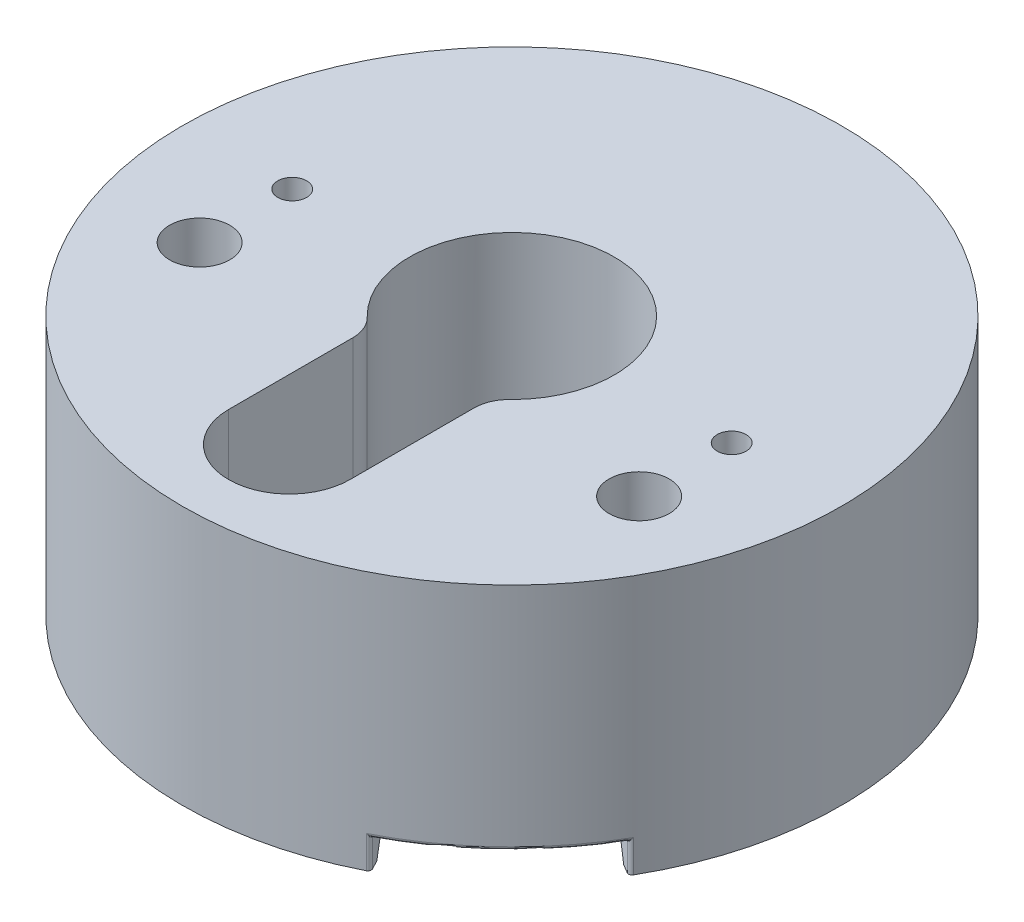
ISO-10303-21;
HEADER;
FILE_DESCRIPTION(('STEP AP214'),'2;1');
FILE_NAME('part.step','',(''),(''),'','','');
FILE_SCHEMA(('AUTOMOTIVE_DESIGN { 1 0 10303 214 1 1 1 1 }'));
ENDSEC;
DATA;
#1=APPLICATION_CONTEXT('core data for automotive mechanical design processes');
#2=APPLICATION_PROTOCOL_DEFINITION('international standard','automotive_design',2000,#1);
#3=PRODUCT_CONTEXT('',#1,'mechanical');
#4=PRODUCT('Part','Part','',(#3));
#5=PRODUCT_RELATED_PRODUCT_CATEGORY('part','',(#4));
#6=PRODUCT_DEFINITION_FORMATION('','',#4);
#7=PRODUCT_DEFINITION_CONTEXT('part definition',#1,'design');
#8=PRODUCT_DEFINITION('design','',#6,#7);
#9=PRODUCT_DEFINITION_SHAPE('','',#8);
#10=(LENGTH_UNIT() NAMED_UNIT(*) SI_UNIT(.MILLI.,.METRE.));
#11=(NAMED_UNIT(*) PLANE_ANGLE_UNIT() SI_UNIT($,.RADIAN.));
#12=(NAMED_UNIT(*) SI_UNIT($,.STERADIAN.) SOLID_ANGLE_UNIT());
#13=UNCERTAINTY_MEASURE_WITH_UNIT(LENGTH_MEASURE(1.E-05),#10,'distance_accuracy_value','');
#14=(GEOMETRIC_REPRESENTATION_CONTEXT(3) GLOBAL_UNCERTAINTY_ASSIGNED_CONTEXT((#13)) GLOBAL_UNIT_ASSIGNED_CONTEXT((#10,
#11,#12)) REPRESENTATION_CONTEXT('',''));
#15=CARTESIAN_POINT('',(0.,0.,0.));
#16=DIRECTION('',(0.,0.,1.));
#17=DIRECTION('',(1.,0.,0.));
#18=AXIS2_PLACEMENT_3D('',#15,#16,#17);
#19=CARTESIAN_POINT('',(0.,22.4,0.));
#20=DIRECTION('',(0.,-1.,0.));
#21=DIRECTION('',(0.,0.,-1.));
#22=AXIS2_PLACEMENT_3D('',#19,#20,#21);
#23=CYLINDRICAL_SURFACE('',#22,28.5);
#24=CARTESIAN_POINT('',(0.,0.,0.));
#25=DIRECTION('',(0.,1.,0.));
#26=DIRECTION('',(0.,0.,1.));
#27=AXIS2_PLACEMENT_3D('',#24,#25,#26);
#28=CIRCLE('',#27,28.5);
#29=CARTESIAN_POINT('',(24.7060394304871,0.,14.2078012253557));
#30=VERTEX_POINT('',#29);
#31=CARTESIAN_POINT('',(12.8457736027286,0.,25.4408352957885));
#32=VERTEX_POINT('',#31);
#33=EDGE_CURVE('E194',#30,#32,#28,.T.);
#34=ORIENTED_EDGE('',*,*,#33,.T.);
#35=DIRECTION('',(0.,-1.,0.));
#36=VECTOR('',#35,1.);
#37=CARTESIAN_POINT('',(12.8457736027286,22.4,25.4408352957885));
#38=LINE('',#37,#36);
#39=CARTESIAN_POINT('',(12.8457736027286,2.8,25.4408352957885));
#40=VERTEX_POINT('',#39);
#41=EDGE_CURVE('E275',#32,#40,#38,.F.);
#42=ORIENTED_EDGE('',*,*,#41,.T.);
#43=CARTESIAN_POINT('',(0.,2.8,0.));
#44=DIRECTION('',(0.,-1.,0.));
#45=DIRECTION('',(0.,0.,-1.));
#46=AXIS2_PLACEMENT_3D('',#43,#44,#45);
#47=CIRCLE('',#46,28.5);
#48=CARTESIAN_POINT('',(24.7060394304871,2.8,14.2078012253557));
#49=VERTEX_POINT('',#48);
#50=EDGE_CURVE('E269',#40,#49,#47,.F.);
#51=ORIENTED_EDGE('',*,*,#50,.T.);
#52=DIRECTION('',(0.,-1.,0.));
#53=VECTOR('',#52,1.);
#54=CARTESIAN_POINT('',(24.7060394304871,22.4,14.2078012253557));
#55=LINE('',#54,#53);
#56=EDGE_CURVE('E272',#49,#30,#55,.T.);
#57=ORIENTED_EDGE('',*,*,#56,.T.);
#58=EDGE_LOOP('',(#34,#42,#51,#57));
#59=FACE_BOUND('',#58,.T.);
#60=CARTESIAN_POINT('',(0.,22.4,0.));
#61=DIRECTION('',(0.,1.,0.));
#62=DIRECTION('',(0.,0.,1.));
#63=AXIS2_PLACEMENT_3D('',#60,#61,#62);
#64=CIRCLE('',#63,28.5);
#65=CARTESIAN_POINT('',(0.,22.4,28.5));
#66=VERTEX_POINT('',#65);
#67=EDGE_CURVE('E202',#66,#66,#64,.T.);
#68=ORIENTED_EDGE('',*,*,#67,.F.);
#69=EDGE_LOOP('',(#68));
#70=FACE_BOUND('',#69,.T.);
#71=ADVANCED_FACE('F48',(#59,#70),#23,.T.);
#72=CARTESIAN_POINT('',(0.,0.,0.));
#73=DIRECTION('',(0.,1.,0.));
#74=DIRECTION('',(0.,0.,1.));
#75=AXIS2_PLACEMENT_3D('',#72,#73,#74);
#76=PLANE('',#75);
#77=DIRECTION('',(0.460199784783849,0.,0.887815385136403));
#78=VECTOR('',#77,1.);
#79=CARTESIAN_POINT('',(13.1156938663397,0.,25.3027384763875));
#80=LINE('',#79,#78);
#81=CARTESIAN_POINT('',(12.5749591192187,0.,24.2595553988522));
#82=VERTEX_POINT('',#81);
#83=CARTESIAN_POINT('',(12.9768995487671,0.,25.0349770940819));
#84=VERTEX_POINT('',#83);
#85=EDGE_CURVE('E183',#82,#84,#80,.T.);
#86=ORIENTED_EDGE('',*,*,#85,.T.);
#87=CARTESIAN_POINT('',(12.7105549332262,0.,25.1730370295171));
#88=DIRECTION('',(0.,1.,0.));
#89=DIRECTION('',(0.,0.,1.));
#90=AXIS2_PLACEMENT_3D('',#87,#88,#89);
#91=CIRCLE('',#90,0.3);
#92=EDGE_CURVE('E284',#84,#32,#91,.F.);
#93=ORIENTED_EDGE('',*,*,#92,.T.);
#94=ORIENTED_EDGE('',*,*,#33,.F.);
#95=CARTESIAN_POINT('',(24.4459758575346,0.,14.0582454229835));
#96=DIRECTION('',(0.,1.,0.));
#97=DIRECTION('',(0.,0.,1.));
#98=AXIS2_PLACEMENT_3D('',#95,#96,#97);
#99=CIRCLE('',#98,0.3);
#100=CARTESIAN_POINT('',(24.293661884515,0.,14.3167032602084));
#101=VERTEX_POINT('',#100);
#102=EDGE_CURVE('E181',#30,#101,#99,.F.);
#103=ORIENTED_EDGE('',*,*,#102,.T.);
#104=DIRECTION('',(-0.861526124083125,0.,-0.507713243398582));
#105=VECTOR('',#104,1.);
#106=CARTESIAN_POINT('',(22.4437776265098,0.,13.2265323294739));
#107=LINE('',#106,#105);
#108=CARTESIAN_POINT('',(23.5412013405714,0.,13.8732643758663));
#109=VERTEX_POINT('',#108);
#110=EDGE_CURVE('E167',#101,#109,#107,.T.);
#111=ORIENTED_EDGE('',*,*,#110,.T.);
#112=CARTESIAN_POINT('',(0.,0.,0.));
#113=DIRECTION('',(0.,-1.,0.));
#114=DIRECTION('',(0.,0.,-1.));
#115=AXIS2_PLACEMENT_3D('',#112,#113,#114);
#116=CIRCLE('',#115,27.325);
#117=EDGE_CURVE('E178',#82,#109,#116,.T.);
#118=ORIENTED_EDGE('',*,*,#117,.F.);
#119=EDGE_LOOP('',(#86,#93,#94,#103,#111,#118));
#120=FACE_BOUND('',#119,.T.);
#121=ADVANCED_FACE('F177',(#120),#76,.F.);
#122=CARTESIAN_POINT('',(0.,0.,0.));
#123=DIRECTION('',(0.,-1.,0.));
#124=DIRECTION('',(0.,0.,-1.));
#125=AXIS2_PLACEMENT_3D('',#122,#123,#124);
#126=CONICAL_SURFACE('',#125,27.325,0.47123889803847);
#127=DIRECTION('',(0.208926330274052,-0.891006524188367,0.403059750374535));
#128=VECTOR('',#127,1.);
#129=CARTESIAN_POINT('',(0.,53.6283320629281,0.));
#130=LINE('',#129,#128);
#131=CARTESIAN_POINT('',(12.0121987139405,2.40000000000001,23.1738805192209));
#132=VERTEX_POINT('',#131);
#133=EDGE_CURVE('E172',#82,#132,#130,.F.);
#134=ORIENTED_EDGE('',*,*,#133,.F.);
#135=ORIENTED_EDGE('',*,*,#117,.T.);
#136=DIRECTION('',(-0.391124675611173,0.891006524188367,-0.230496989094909));
#137=VECTOR('',#136,1.);
#138=CARTESIAN_POINT('',(0.,53.6283320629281,0.));
#139=LINE('',#138,#137);
#140=CARTESIAN_POINT('',(22.4876745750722,2.40000000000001,13.2524016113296));
#141=VERTEX_POINT('',#140);
#142=EDGE_CURVE('E164',#141,#109,#139,.F.);
#143=ORIENTED_EDGE('',*,*,#142,.F.);
#144=CARTESIAN_POINT('',(22.4876745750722,2.4,13.2524016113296));
#145=CARTESIAN_POINT('',(22.4849688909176,2.40616565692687,13.2508049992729));
#146=CARTESIAN_POINT('',(22.4819705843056,2.41233441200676,13.2497021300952));
#147=CARTESIAN_POINT('',(22.475460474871,2.42452213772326,13.2485175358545));
#148=CARTESIAN_POINT('',(22.471947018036,2.43054054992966,13.248439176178));
#149=CARTESIAN_POINT('',(22.4644907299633,2.44223895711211,13.2493490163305));
#150=CARTESIAN_POINT('',(22.4605471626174,2.44791834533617,13.250339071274));
#151=CARTESIAN_POINT('',(22.4523437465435,2.45872170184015,13.2534094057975));
#152=CARTESIAN_POINT('',(22.4480843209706,2.46384639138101,13.2554882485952));
#153=CARTESIAN_POINT('',(22.4396644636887,2.47301513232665,13.2605564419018));
#154=CARTESIAN_POINT('',(22.4355160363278,2.47710816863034,13.2634766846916));
#155=CARTESIAN_POINT('',(22.4271889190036,2.48443503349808,13.2702225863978));
#156=CARTESIAN_POINT('',(22.4230102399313,2.48766915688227,13.2740479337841));
#157=CARTESIAN_POINT('',(22.4152608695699,2.49278378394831,13.2820180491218));
#158=CARTESIAN_POINT('',(22.4116752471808,2.49477670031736,13.2860764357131));
#159=CARTESIAN_POINT('',(22.4047438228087,2.49783714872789,13.2947062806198));
#160=CARTESIAN_POINT('',(22.4013974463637,2.49890697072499,13.2992764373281));
#161=CARTESIAN_POINT('',(22.3973035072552,2.49965761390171,13.3054199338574));
#162=CARTESIAN_POINT('',(22.3963859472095,2.49978601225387,13.3068362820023));
#163=CARTESIAN_POINT('',(22.3945865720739,2.49995707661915,13.3096936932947));
#164=CARTESIAN_POINT('',(22.3937047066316,2.49999986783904,13.3111347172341));
#165=CARTESIAN_POINT('',(22.3928409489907,2.5,13.3125874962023));
#166=B_SPLINE_CURVE_WITH_KNOTS('',3,(#144,#145,#146,#147,#148,#149,#150,#151,#152,#153,#154,
#155,#156,#157,#158,#159,#160,#161,#162,#163,#164,#165),.UNSPECIFIED.,.F.,.F.,(4,2,2,2,2,2,2,2,
2,2,4),(0.,0.0207420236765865,0.0415521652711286,0.0623984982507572,0.083217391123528,
0.10266296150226,0.122101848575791,0.139320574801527,0.156496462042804,0.161571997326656,
0.166640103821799),.UNSPECIFIED.);
#167=CARTESIAN_POINT('',(22.3928409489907,2.5,13.3125874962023));
#168=VERTEX_POINT('',#167);
#169=EDGE_CURVE('E11',#141,#168,#166,.T.);
#170=ORIENTED_EDGE('',*,*,#169,.T.);
#171=CARTESIAN_POINT('',(0.,2.5,0.));
#172=DIRECTION('',(0.,-1.,0.));
#173=DIRECTION('',(0.,0.,-1.));
#174=AXIS2_PLACEMENT_3D('',#171,#172,#173);
#175=CIRCLE('',#174,26.0511863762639);
#176=CARTESIAN_POINT('',(12.0774435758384,2.5,23.0824536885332));
#177=VERTEX_POINT('',#176);
#178=EDGE_CURVE('E187',#177,#168,#175,.T.);
#179=ORIENTED_EDGE('',*,*,#178,.F.);
#180=CARTESIAN_POINT('',(12.0774435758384,2.5,23.0824536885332));
#181=CARTESIAN_POINT('',(12.0728352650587,2.50000635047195,23.0848613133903));
#182=CARTESIAN_POINT('',(12.0683293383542,2.49959496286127,23.0874537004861));
#183=CARTESIAN_POINT('',(12.0596550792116,2.49798835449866,23.0929093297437));
#184=CARTESIAN_POINT('',(12.0554855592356,2.49679603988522,23.0957715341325));
#185=CARTESIAN_POINT('',(12.047583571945,2.4936795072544,23.1016854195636));
#186=CARTESIAN_POINT('',(12.043850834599,2.49175574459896,23.1047369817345));
#187=CARTESIAN_POINT('',(12.0368979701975,2.48725714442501,23.1109444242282));
#188=CARTESIAN_POINT('',(12.0336781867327,2.48468187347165,23.1141003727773));
#189=CARTESIAN_POINT('',(12.0276799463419,2.47884863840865,23.1205725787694));
#190=CARTESIAN_POINT('',(12.0249268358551,2.47556581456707,23.1238898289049));
#191=CARTESIAN_POINT('',(12.0200739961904,2.46850214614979,23.1304689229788));
#192=CARTESIAN_POINT('',(12.0179744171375,2.46472118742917,23.1337307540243));
#193=CARTESIAN_POINT('',(12.0142601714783,2.45635808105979,23.1404613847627));
#194=CARTESIAN_POINT('',(12.0127173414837,2.45173353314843,23.1439170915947));
#195=CARTESIAN_POINT('',(12.0104393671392,2.44213626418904,23.1506084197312));
#196=CARTESIAN_POINT('',(12.0097049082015,2.43716325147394,23.1538438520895));
#197=CARTESIAN_POINT('',(12.0090247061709,2.42688175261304,23.1600978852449));
#198=CARTESIAN_POINT('',(12.0090965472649,2.42156831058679,23.1631102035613));
#199=CARTESIAN_POINT('',(12.0100486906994,2.41083583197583,23.1687761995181));
#200=CARTESIAN_POINT('',(12.0109275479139,2.40541700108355,23.171430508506));
#201=CARTESIAN_POINT('',(12.0121987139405,2.4,23.1738805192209));
#202=B_SPLINE_CURVE_WITH_KNOTS('',3,(#180,#181,#182,#183,#184,#185,#186,#187,#188,#189,#190,
#191,#192,#193,#194,#195,#196,#197,#198,#199,#200,#201),.UNSPECIFIED.,.F.,.F.,(4,2,2,2,2,2,2,2,
2,2,4),(0.,0.0155697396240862,0.0310818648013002,0.0465843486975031,0.0620971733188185,
0.0782860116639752,0.0944785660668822,0.112332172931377,0.130200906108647,0.148460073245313,
0.166686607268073),.UNSPECIFIED.);
#203=EDGE_CURVE('E59',#177,#132,#202,.T.);
#204=ORIENTED_EDGE('',*,*,#203,.T.);
#205=EDGE_LOOP('',(#134,#135,#143,#170,#179,#204));
#206=FACE_BOUND('',#205,.T.);
#207=ADVANCED_FACE('F185',(#206),#126,.F.);
#208=CARTESIAN_POINT('',(0.,22.4,0.));
#209=DIRECTION('',(0.,1.,0.));
#210=DIRECTION('',(0.,0.,1.));
#211=AXIS2_PLACEMENT_3D('',#208,#209,#210);
#212=PLANE('',#211);
#213=CARTESIAN_POINT('',(19.,22.4,8.));
#214=DIRECTION('',(0.,1.,0.));
#215=DIRECTION('',(0.,0.,1.));
#216=AXIS2_PLACEMENT_3D('',#213,#214,#215);
#217=CIRCLE('',#216,2.6);
#218=CARTESIAN_POINT('',(19.,22.4,10.6));
#219=VERTEX_POINT('',#218);
#220=EDGE_CURVE('E431',#219,#219,#217,.T.);
#221=ORIENTED_EDGE('',*,*,#220,.F.);
#222=EDGE_LOOP('',(#221));
#223=FACE_BOUND('',#222,.T.);
#224=CARTESIAN_POINT('',(-19.,22.4,7.99999999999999));
#225=DIRECTION('',(0.,1.,0.));
#226=DIRECTION('',(0.,0.,1.));
#227=AXIS2_PLACEMENT_3D('',#224,#225,#226);
#228=CIRCLE('',#227,2.6);
#229=CARTESIAN_POINT('',(-19.,22.4,10.6));
#230=VERTEX_POINT('',#229);
#231=EDGE_CURVE('E449',#230,#230,#228,.T.);
#232=ORIENTED_EDGE('',*,*,#231,.F.);
#233=EDGE_LOOP('',(#232));
#234=FACE_BOUND('',#233,.T.);
#235=DIRECTION('',(0.,0.,1.));
#236=VECTOR('',#235,1.);
#237=CARTESIAN_POINT('',(-5.25,22.4,7.12460525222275));
#238=LINE('',#237,#236);
#239=CARTESIAN_POINT('',(-5.25,22.4,8.50646812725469));
#240=VERTEX_POINT('',#239);
#241=CARTESIAN_POINT('',(-5.25,22.4,19.25));
#242=VERTEX_POINT('',#241);
#243=EDGE_CURVE('E472',#240,#242,#238,.T.);
#244=ORIENTED_EDGE('',*,*,#243,.F.);
#245=CARTESIAN_POINT('',(-8.25,22.4,8.50646812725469));
#246=DIRECTION('',(0.,1.,0.));
#247=DIRECTION('',(0.,0.,1.));
#248=AXIS2_PLACEMENT_3D('',#245,#246,#247);
#249=CIRCLE('',#248,3.);
#250=CARTESIAN_POINT('',(-6.16139240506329,22.4,6.35293189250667));
#251=VERTEX_POINT('',#250);
#252=EDGE_CURVE('E216',#240,#251,#249,.T.);
#253=ORIENTED_EDGE('',*,*,#252,.T.);
#254=CARTESIAN_POINT('',(0.,22.4,0.));
#255=DIRECTION('',(0.,1.,0.));
#256=DIRECTION('',(0.,0.,1.));
#257=AXIS2_PLACEMENT_3D('',#254,#255,#256);
#258=CIRCLE('',#257,8.85);
#259=CARTESIAN_POINT('',(6.16139240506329,22.4,6.35293189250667));
#260=VERTEX_POINT('',#259);
#261=EDGE_CURVE('E456',#260,#251,#258,.T.);
#262=ORIENTED_EDGE('',*,*,#261,.F.);
#263=CARTESIAN_POINT('',(8.25,22.4,8.50646812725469));
#264=DIRECTION('',(0.,1.,0.));
#265=DIRECTION('',(0.,0.,1.));
#266=AXIS2_PLACEMENT_3D('',#263,#264,#265);
#267=CIRCLE('',#266,3.);
#268=CARTESIAN_POINT('',(5.25,22.4,8.50646812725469));
#269=VERTEX_POINT('',#268);
#270=EDGE_CURVE('E213',#260,#269,#267,.T.);
#271=ORIENTED_EDGE('',*,*,#270,.T.);
#272=DIRECTION('',(0.,0.,-1.));
#273=VECTOR('',#272,1.);
#274=CARTESIAN_POINT('',(5.25,22.4,7.12460525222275));
#275=LINE('',#274,#273);
#276=CARTESIAN_POINT('',(5.25,22.4,19.25));
#277=VERTEX_POINT('',#276);
#278=EDGE_CURVE('E461',#277,#269,#275,.T.);
#279=ORIENTED_EDGE('',*,*,#278,.F.);
#280=CARTESIAN_POINT('',(0.,22.4,19.25));
#281=DIRECTION('',(0.,1.,0.));
#282=DIRECTION('',(0.,0.,1.));
#283=AXIS2_PLACEMENT_3D('',#280,#281,#282);
#284=CIRCLE('',#283,5.25);
#285=EDGE_CURVE('E475',#242,#277,#284,.T.);
#286=ORIENTED_EDGE('',*,*,#285,.F.);
#287=EDGE_LOOP('',(#244,#253,#262,#271,#279,#286));
#288=FACE_BOUND('',#287,.T.);
#289=CARTESIAN_POINT('',(19.,22.4,0.));
#290=DIRECTION('',(0.,-1.,0.));
#291=DIRECTION('',(0.,0.,-1.));
#292=AXIS2_PLACEMENT_3D('',#289,#290,#291);
#293=CIRCLE('',#292,1.24999999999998);
#294=CARTESIAN_POINT('',(19.,22.4,-1.24999999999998));
#295=VERTEX_POINT('',#294);
#296=EDGE_CURVE('E496',#295,#295,#293,.T.);
#297=ORIENTED_EDGE('',*,*,#296,.T.);
#298=EDGE_LOOP('',(#297));
#299=FACE_BOUND('',#298,.T.);
#300=CARTESIAN_POINT('',(-19.,22.4,0.));
#301=DIRECTION('',(0.,-1.,0.));
#302=DIRECTION('',(0.,0.,-1.));
#303=AXIS2_PLACEMENT_3D('',#300,#301,#302);
#304=CIRCLE('',#303,1.24999999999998);
#305=CARTESIAN_POINT('',(-19.,22.4,-1.24999999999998));
#306=VERTEX_POINT('',#305);
#307=EDGE_CURVE('E188',#306,#306,#304,.T.);
#308=ORIENTED_EDGE('',*,*,#307,.T.);
#309=EDGE_LOOP('',(#308));
#310=FACE_BOUND('',#309,.T.);
#311=ORIENTED_EDGE('',*,*,#67,.T.);
#312=EDGE_LOOP('',(#311));
#313=FACE_BOUND('',#312,.T.);
#314=ADVANCED_FACE('F381',(#223,#234,#288,#299,#310,#313),#212,.T.);
#315=CARTESIAN_POINT('',(0.,2.5,0.));
#316=DIRECTION('',(0.,-1.,0.));
#317=DIRECTION('',(0.,0.,-1.));
#318=AXIS2_PLACEMENT_3D('',#315,#316,#317);
#319=PLANE('',#318);
#320=CARTESIAN_POINT('',(-19.,2.5,7.99999999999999));
#321=DIRECTION('',(0.,-1.,0.));
#322=DIRECTION('',(0.,0.,-1.));
#323=AXIS2_PLACEMENT_3D('',#320,#321,#322);
#324=CIRCLE('',#323,5.1);
#325=CARTESIAN_POINT('',(-19.,2.5,2.89999999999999));
#326=VERTEX_POINT('',#325);
#327=EDGE_CURVE('E253',#326,#326,#324,.F.);
#328=ORIENTED_EDGE('',*,*,#327,.T.);
#329=EDGE_LOOP('',(#328));
#330=FACE_BOUND('',#329,.T.);
#331=CARTESIAN_POINT('',(19.,2.5,8.));
#332=DIRECTION('',(0.,-1.,0.));
#333=DIRECTION('',(0.,0.,-1.));
#334=AXIS2_PLACEMENT_3D('',#331,#332,#333);
#335=CIRCLE('',#334,5.1);
#336=CARTESIAN_POINT('',(19.,2.5,2.9));
#337=VERTEX_POINT('',#336);
#338=EDGE_CURVE('E249',#337,#337,#335,.F.);
#339=ORIENTED_EDGE('',*,*,#338,.T.);
#340=EDGE_LOOP('',(#339));
#341=FACE_BOUND('',#340,.T.);
#342=CARTESIAN_POINT('',(0.,2.5,0.));
#343=DIRECTION('',(0.,-1.,0.));
#344=DIRECTION('',(0.,0.,-1.));
#345=AXIS2_PLACEMENT_3D('',#342,#343,#344);
#346=CIRCLE('',#345,9.85);
#347=CARTESIAN_POINT('',(0.,2.5,-9.85));
#348=VERTEX_POINT('',#347);
#349=EDGE_CURVE('E241',#348,#348,#346,.F.);
#350=ORIENTED_EDGE('',*,*,#349,.T.);
#351=EDGE_LOOP('',(#350));
#352=FACE_BOUND('',#351,.T.);
#353=CARTESIAN_POINT('',(19.,2.5,0.));
#354=DIRECTION('',(0.,-1.,0.));
#355=DIRECTION('',(0.,0.,-1.));
#356=AXIS2_PLACEMENT_3D('',#353,#354,#355);
#357=CIRCLE('',#356,1.4);
#358=CARTESIAN_POINT('',(19.,2.5,-1.4));
#359=VERTEX_POINT('',#358);
#360=EDGE_CURVE('E485',#359,#359,#357,.T.);
#361=ORIENTED_EDGE('',*,*,#360,.F.);
#362=EDGE_LOOP('',(#361));
#363=FACE_BOUND('',#362,.T.);
#364=CARTESIAN_POINT('',(-19.,2.5,0.));
#365=DIRECTION('',(0.,-1.,0.));
#366=DIRECTION('',(0.,0.,-1.));
#367=AXIS2_PLACEMENT_3D('',#364,#365,#366);
#368=CIRCLE('',#367,1.4);
#369=CARTESIAN_POINT('',(-19.,2.5,-1.4));
#370=VERTEX_POINT('',#369);
#371=EDGE_CURVE('E500',#370,#370,#368,.T.);
#372=ORIENTED_EDGE('',*,*,#371,.F.);
#373=EDGE_LOOP('',(#372));
#374=FACE_BOUND('',#373,.T.);
#375=CARTESIAN_POINT('',(0.,2.5,0.));
#376=DIRECTION('',(0.,-1.,0.));
#377=DIRECTION('',(0.,0.,-1.));
#378=AXIS2_PLACEMENT_3D('',#375,#376,#377);
#379=CIRCLE('',#378,28.2);
#380=CARTESIAN_POINT('',(24.24411390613,2.5,14.4035738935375));
#381=VERTEX_POINT('',#380);
#382=CARTESIAN_POINT('',(13.0663316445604,2.5,24.9902176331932));
#383=VERTEX_POINT('',#382);
#384=EDGE_CURVE('E290',#381,#383,#379,.T.);
#385=ORIENTED_EDGE('',*,*,#384,.T.);
#386=CARTESIAN_POINT('',(12.7105549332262,2.5,25.1730370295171));
#387=DIRECTION('',(0.,-1.,0.));
#388=DIRECTION('',(0.,0.,-1.));
#389=AXIS2_PLACEMENT_3D('',#386,#387,#388);
#390=CIRCLE('',#389,0.4);
#391=CARTESIAN_POINT('',(13.0656810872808,2.5,24.9889571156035));
#392=VERTEX_POINT('',#391);
#393=EDGE_CURVE('E523',#383,#392,#390,.F.);
#394=ORIENTED_EDGE('',*,*,#393,.T.);
#395=DIRECTION('',(-0.460199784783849,0.,-0.887815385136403));
#396=VECTOR('',#395,1.);
#397=CARTESIAN_POINT('',(12.0775319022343,2.5,23.0826240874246));
#398=LINE('',#397,#396);
#399=EDGE_CURVE('E538',#392,#177,#398,.T.);
#400=ORIENTED_EDGE('',*,*,#399,.T.);
#401=ORIENTED_EDGE('',*,*,#178,.T.);
#402=DIRECTION('',(0.861526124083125,0.,0.507713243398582));
#403=VECTOR('',#402,1.);
#404=CARTESIAN_POINT('',(24.2428905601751,2.5,14.4028558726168));
#405=LINE('',#404,#403);
#406=CARTESIAN_POINT('',(24.2428905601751,2.5,14.4028558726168));
#407=VERTEX_POINT('',#406);
#408=EDGE_CURVE('E576',#168,#407,#405,.T.);
#409=ORIENTED_EDGE('',*,*,#408,.T.);
#410=CARTESIAN_POINT('',(24.4459758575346,2.5,14.0582454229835));
#411=DIRECTION('',(0.,-1.,0.));
#412=DIRECTION('',(0.,0.,-1.));
#413=AXIS2_PLACEMENT_3D('',#410,#411,#412);
#414=CIRCLE('',#413,0.4);
#415=EDGE_CURVE('E526',#407,#381,#414,.F.);
#416=ORIENTED_EDGE('',*,*,#415,.T.);
#417=EDGE_LOOP('',(#385,#394,#400,#401,#409,#416));
#418=FACE_BOUND('',#417,.T.);
#419=ADVANCED_FACE('F382',(#330,#341,#352,#363,#374,#418),#319,.T.);
#420=CARTESIAN_POINT('',(-19.,2.5,0.));
#421=DIRECTION('',(0.,-1.,0.));
#422=DIRECTION('',(0.,0.,-1.));
#423=AXIS2_PLACEMENT_3D('',#420,#421,#422);
#424=CYLINDRICAL_SURFACE('',#423,1.24999999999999);
#425=ORIENTED_EDGE('',*,*,#307,.F.);
#426=EDGE_LOOP('',(#425));
#427=FACE_BOUND('',#426,.T.);
#428=CARTESIAN_POINT('',(-19.,2.65,0.));
#429=DIRECTION('',(0.,-1.,0.));
#430=DIRECTION('',(0.,0.,-1.));
#431=AXIS2_PLACEMENT_3D('',#428,#429,#430);
#432=CIRCLE('',#431,1.25);
#433=CARTESIAN_POINT('',(-19.,2.65,-1.25));
#434=VERTEX_POINT('',#433);
#435=EDGE_CURVE('E198',#434,#434,#432,.T.);
#436=ORIENTED_EDGE('',*,*,#435,.T.);
#437=EDGE_LOOP('',(#436));
#438=FACE_BOUND('',#437,.T.);
#439=ADVANCED_FACE('F508',(#427,#438),#424,.F.);
#440=CARTESIAN_POINT('',(-19.,2.5,0.));
#441=DIRECTION('',(0.,-1.,0.));
#442=DIRECTION('',(0.,0.,-1.));
#443=AXIS2_PLACEMENT_3D('',#440,#441,#442);
#444=CONICAL_SURFACE('',#443,1.4,0.785398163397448);
#445=ORIENTED_EDGE('',*,*,#435,.F.);
#446=EDGE_LOOP('',(#445));
#447=FACE_BOUND('',#446,.T.);
#448=ORIENTED_EDGE('',*,*,#371,.T.);
#449=EDGE_LOOP('',(#448));
#450=FACE_BOUND('',#449,.T.);
#451=ADVANCED_FACE('F510',(#447,#450),#444,.F.);
#452=CARTESIAN_POINT('',(19.,2.5,0.));
#453=DIRECTION('',(0.,-1.,0.));
#454=DIRECTION('',(0.,0.,-1.));
#455=AXIS2_PLACEMENT_3D('',#452,#453,#454);
#456=CYLINDRICAL_SURFACE('',#455,1.24999999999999);
#457=ORIENTED_EDGE('',*,*,#296,.F.);
#458=EDGE_LOOP('',(#457));
#459=FACE_BOUND('',#458,.T.);
#460=CARTESIAN_POINT('',(19.,2.65,0.));
#461=DIRECTION('',(0.,-1.,0.));
#462=DIRECTION('',(0.,0.,-1.));
#463=AXIS2_PLACEMENT_3D('',#460,#461,#462);
#464=CIRCLE('',#463,1.25);
#465=CARTESIAN_POINT('',(19.,2.65,-1.25));
#466=VERTEX_POINT('',#465);
#467=EDGE_CURVE('E492',#466,#466,#464,.T.);
#468=ORIENTED_EDGE('',*,*,#467,.T.);
#469=EDGE_LOOP('',(#468));
#470=FACE_BOUND('',#469,.T.);
#471=ADVANCED_FACE('F513',(#459,#470),#456,.F.);
#472=CARTESIAN_POINT('',(19.,2.5,0.));
#473=DIRECTION('',(0.,-1.,0.));
#474=DIRECTION('',(0.,0.,-1.));
#475=AXIS2_PLACEMENT_3D('',#472,#473,#474);
#476=CONICAL_SURFACE('',#475,1.4,0.785398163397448);
#477=ORIENTED_EDGE('',*,*,#467,.F.);
#478=EDGE_LOOP('',(#477));
#479=FACE_BOUND('',#478,.T.);
#480=ORIENTED_EDGE('',*,*,#360,.T.);
#481=EDGE_LOOP('',(#480));
#482=FACE_BOUND('',#481,.T.);
#483=ADVANCED_FACE('F722',(#479,#482),#476,.F.);
#484=CARTESIAN_POINT('',(0.,8.4,0.));
#485=DIRECTION('',(0.,1.,0.));
#486=DIRECTION('',(0.,0.,1.));
#487=AXIS2_PLACEMENT_3D('',#484,#485,#486);
#488=CYLINDRICAL_SURFACE('',#487,8.85);
#489=CARTESIAN_POINT('',(0.,3.5,0.));
#490=DIRECTION('',(0.,-1.,0.));
#491=DIRECTION('',(0.,0.,-1.));
#492=AXIS2_PLACEMENT_3D('',#489,#490,#491);
#493=CIRCLE('',#492,8.85);
#494=CARTESIAN_POINT('',(0.,3.5,-8.85));
#495=VERTEX_POINT('',#494);
#496=EDGE_CURVE('E237',#495,#495,#493,.T.);
#497=ORIENTED_EDGE('',*,*,#496,.T.);
#498=EDGE_LOOP('',(#497));
#499=FACE_BOUND('',#498,.T.);
#500=ORIENTED_EDGE('',*,*,#261,.T.);
#501=DIRECTION('',(0.,1.,0.));
#502=VECTOR('',#501,1.);
#503=CARTESIAN_POINT('',(-6.16139240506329,8.4,6.35293189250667));
#504=LINE('',#503,#502);
#505=CARTESIAN_POINT('',(-6.16139240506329,8.4,6.35293189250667));
#506=VERTEX_POINT('',#505);
#507=EDGE_CURVE('E223',#251,#506,#504,.F.);
#508=ORIENTED_EDGE('',*,*,#507,.T.);
#509=CARTESIAN_POINT('',(0.,8.4,0.));
#510=DIRECTION('',(0.,1.,0.));
#511=DIRECTION('',(0.,0.,1.));
#512=AXIS2_PLACEMENT_3D('',#509,#510,#511);
#513=CIRCLE('',#512,8.85);
#514=CARTESIAN_POINT('',(6.16139240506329,8.4,6.35293189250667));
#515=VERTEX_POINT('',#514);
#516=EDGE_CURVE('E453',#506,#515,#513,.T.);
#517=ORIENTED_EDGE('',*,*,#516,.T.);
#518=DIRECTION('',(0.,1.,0.));
#519=VECTOR('',#518,1.);
#520=CARTESIAN_POINT('',(6.16139240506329,8.4,6.35293189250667));
#521=LINE('',#520,#519);
#522=EDGE_CURVE('E219',#515,#260,#521,.T.);
#523=ORIENTED_EDGE('',*,*,#522,.T.);
#524=EDGE_LOOP('',(#500,#508,#517,#523));
#525=FACE_BOUND('',#524,.T.);
#526=ADVANCED_FACE('F712',(#499,#525),#488,.F.);
#527=CARTESIAN_POINT('',(5.25,8.4,7.12460525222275));
#528=DIRECTION('',(1.,0.,0.));
#529=DIRECTION('',(0.,0.,-1.));
#530=AXIS2_PLACEMENT_3D('',#527,#528,#529);
#531=PLANE('',#530);
#532=ORIENTED_EDGE('',*,*,#278,.T.);
#533=DIRECTION('',(0.,1.,0.));
#534=VECTOR('',#533,1.);
#535=CARTESIAN_POINT('',(5.25,8.4,8.50646812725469));
#536=LINE('',#535,#534);
#537=CARTESIAN_POINT('',(5.25,8.4,8.50646812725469));
#538=VERTEX_POINT('',#537);
#539=EDGE_CURVE('E227',#269,#538,#536,.F.);
#540=ORIENTED_EDGE('',*,*,#539,.T.);
#541=DIRECTION('',(0.,0.,-1.));
#542=VECTOR('',#541,1.);
#543=CARTESIAN_POINT('',(5.25,8.4,7.12460525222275));
#544=LINE('',#543,#542);
#545=CARTESIAN_POINT('',(5.25,8.4,19.25));
#546=VERTEX_POINT('',#545);
#547=EDGE_CURVE('E465',#546,#538,#544,.T.);
#548=ORIENTED_EDGE('',*,*,#547,.F.);
#549=DIRECTION('',(0.,1.,0.));
#550=VECTOR('',#549,1.);
#551=CARTESIAN_POINT('',(5.25,8.4,19.25));
#552=LINE('',#551,#550);
#553=EDGE_CURVE('E482',#546,#277,#552,.T.);
#554=ORIENTED_EDGE('',*,*,#553,.T.);
#555=EDGE_LOOP('',(#532,#540,#548,#554));
#556=FACE_BOUND('',#555,.T.);
#557=ADVANCED_FACE('F708',(#556),#531,.F.);
#558=CARTESIAN_POINT('',(0.,8.4,19.25));
#559=DIRECTION('',(0.,1.,0.));
#560=DIRECTION('',(0.,0.,1.));
#561=AXIS2_PLACEMENT_3D('',#558,#559,#560);
#562=CYLINDRICAL_SURFACE('',#561,5.25);
#563=ORIENTED_EDGE('',*,*,#285,.T.);
#564=ORIENTED_EDGE('',*,*,#553,.F.);
#565=CARTESIAN_POINT('',(0.,8.4,19.25));
#566=DIRECTION('',(0.,1.,0.));
#567=DIRECTION('',(0.,0.,1.));
#568=AXIS2_PLACEMENT_3D('',#565,#566,#567);
#569=CIRCLE('',#568,5.25);
#570=CARTESIAN_POINT('',(-5.25,8.4,19.25));
#571=VERTEX_POINT('',#570);
#572=EDGE_CURVE('E460',#571,#546,#569,.T.);
#573=ORIENTED_EDGE('',*,*,#572,.F.);
#574=DIRECTION('',(0.,1.,0.));
#575=VECTOR('',#574,1.);
#576=CARTESIAN_POINT('',(-5.25,8.4,19.25));
#577=LINE('',#576,#575);
#578=EDGE_CURVE('E468',#571,#242,#577,.T.);
#579=ORIENTED_EDGE('',*,*,#578,.T.);
#580=EDGE_LOOP('',(#563,#564,#573,#579));
#581=FACE_BOUND('',#580,.T.);
#582=ADVANCED_FACE('F711',(#581),#562,.F.);
#583=CARTESIAN_POINT('',(-5.25,8.4,7.12460525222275));
#584=DIRECTION('',(-1.,0.,0.));
#585=DIRECTION('',(0.,0.,1.));
#586=AXIS2_PLACEMENT_3D('',#583,#584,#585);
#587=PLANE('',#586);
#588=DIRECTION('',(0.,0.,1.));
#589=VECTOR('',#588,1.);
#590=CARTESIAN_POINT('',(-5.25,8.4,7.12460525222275));
#591=LINE('',#590,#589);
#592=CARTESIAN_POINT('',(-5.25,8.4,8.50646812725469));
#593=VERTEX_POINT('',#592);
#594=EDGE_CURVE('E457',#593,#571,#591,.T.);
#595=ORIENTED_EDGE('',*,*,#594,.F.);
#596=DIRECTION('',(0.,1.,0.));
#597=VECTOR('',#596,1.);
#598=CARTESIAN_POINT('',(-5.25,8.4,8.50646812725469));
#599=LINE('',#598,#597);
#600=EDGE_CURVE('E206',#593,#240,#599,.T.);
#601=ORIENTED_EDGE('',*,*,#600,.T.);
#602=ORIENTED_EDGE('',*,*,#243,.T.);
#603=ORIENTED_EDGE('',*,*,#578,.F.);
#604=EDGE_LOOP('',(#595,#601,#602,#603));
#605=FACE_BOUND('',#604,.T.);
#606=ADVANCED_FACE('F706',(#605),#587,.F.);
#607=CARTESIAN_POINT('',(0.,8.4,0.));
#608=DIRECTION('',(0.,1.,0.));
#609=DIRECTION('',(0.,0.,1.));
#610=AXIS2_PLACEMENT_3D('',#607,#608,#609);
#611=PLANE('',#610);
#612=ORIENTED_EDGE('',*,*,#516,.F.);
#613=CARTESIAN_POINT('',(-8.25,8.4,8.50646812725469));
#614=DIRECTION('',(0.,1.,0.));
#615=DIRECTION('',(0.,0.,1.));
#616=AXIS2_PLACEMENT_3D('',#613,#614,#615);
#617=CIRCLE('',#616,3.);
#618=EDGE_CURVE('E230',#506,#593,#617,.F.);
#619=ORIENTED_EDGE('',*,*,#618,.T.);
#620=ORIENTED_EDGE('',*,*,#594,.T.);
#621=ORIENTED_EDGE('',*,*,#572,.T.);
#622=ORIENTED_EDGE('',*,*,#547,.T.);
#623=CARTESIAN_POINT('',(8.25,8.4,8.50646812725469));
#624=DIRECTION('',(0.,1.,0.));
#625=DIRECTION('',(0.,0.,1.));
#626=AXIS2_PLACEMENT_3D('',#623,#624,#625);
#627=CIRCLE('',#626,3.);
#628=EDGE_CURVE('E233',#538,#515,#627,.F.);
#629=ORIENTED_EDGE('',*,*,#628,.T.);
#630=EDGE_LOOP('',(#612,#619,#620,#621,#622,#629));
#631=FACE_BOUND('',#630,.T.);
#632=ADVANCED_FACE('F702',(#631),#611,.T.);
#633=CARTESIAN_POINT('',(-19.,2.5,7.99999999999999));
#634=DIRECTION('',(0.,-1.,0.));
#635=DIRECTION('',(0.,0.,-1.));
#636=AXIS2_PLACEMENT_3D('',#633,#634,#635);
#637=CYLINDRICAL_SURFACE('',#636,2.6);
#638=CARTESIAN_POINT('',(-19.,14.6,7.99999999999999));
#639=DIRECTION('',(0.,-1.,0.));
#640=DIRECTION('',(0.,0.,-1.));
#641=AXIS2_PLACEMENT_3D('',#638,#639,#640);
#642=CIRCLE('',#641,2.6);
#643=CARTESIAN_POINT('',(-19.,14.6,5.39999999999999));
#644=VERTEX_POINT('',#643);
#645=EDGE_CURVE('E439',#644,#644,#642,.T.);
#646=ORIENTED_EDGE('',*,*,#645,.T.);
#647=EDGE_LOOP('',(#646));
#648=FACE_BOUND('',#647,.T.);
#649=ORIENTED_EDGE('',*,*,#231,.T.);
#650=EDGE_LOOP('',(#649));
#651=FACE_BOUND('',#650,.T.);
#652=ADVANCED_FACE('F698',(#648,#651),#637,.F.);
#653=CARTESIAN_POINT('',(-19.,12.5,7.99999999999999));
#654=DIRECTION('',(0.,-1.,0.));
#655=DIRECTION('',(0.,0.,-1.));
#656=AXIS2_PLACEMENT_3D('',#653,#654,#655);
#657=CONICAL_SURFACE('',#656,4.7,0.785398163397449);
#658=ORIENTED_EDGE('',*,*,#645,.F.);
#659=EDGE_LOOP('',(#658));
#660=FACE_BOUND('',#659,.T.);
#661=CARTESIAN_POINT('',(-19.,12.5,7.99999999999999));
#662=DIRECTION('',(0.,-1.,0.));
#663=DIRECTION('',(0.,0.,-1.));
#664=AXIS2_PLACEMENT_3D('',#661,#662,#663);
#665=CIRCLE('',#664,4.7);
#666=CARTESIAN_POINT('',(-19.,12.5,3.29999999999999));
#667=VERTEX_POINT('',#666);
#668=EDGE_CURVE('E433',#667,#667,#665,.T.);
#669=ORIENTED_EDGE('',*,*,#668,.T.);
#670=EDGE_LOOP('',(#669));
#671=FACE_BOUND('',#670,.T.);
#672=ADVANCED_FACE('F694',(#660,#671),#657,.F.);
#673=CARTESIAN_POINT('',(-19.,2.5,7.99999999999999));
#674=DIRECTION('',(0.,-1.,0.));
#675=DIRECTION('',(0.,0.,-1.));
#676=AXIS2_PLACEMENT_3D('',#673,#674,#675);
#677=CYLINDRICAL_SURFACE('',#676,4.7);
#678=CARTESIAN_POINT('',(-19.,2.9,7.99999999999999));
#679=DIRECTION('',(0.,-1.,0.));
#680=DIRECTION('',(0.,0.,-1.));
#681=AXIS2_PLACEMENT_3D('',#678,#679,#680);
#682=CIRCLE('',#681,4.7);
#683=CARTESIAN_POINT('',(-19.,2.9,3.29999999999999));
#684=VERTEX_POINT('',#683);
#685=EDGE_CURVE('E245',#684,#684,#682,.T.);
#686=ORIENTED_EDGE('',*,*,#685,.T.);
#687=EDGE_LOOP('',(#686));
#688=FACE_BOUND('',#687,.T.);
#689=ORIENTED_EDGE('',*,*,#668,.F.);
#690=EDGE_LOOP('',(#689));
#691=FACE_BOUND('',#690,.T.);
#692=ADVANCED_FACE('F427',(#688,#691),#677,.F.);
#693=CARTESIAN_POINT('',(19.,2.5,8.));
#694=DIRECTION('',(0.,-1.,0.));
#695=DIRECTION('',(0.,0.,-1.));
#696=AXIS2_PLACEMENT_3D('',#693,#694,#695);
#697=CYLINDRICAL_SURFACE('',#696,2.6);
#698=CARTESIAN_POINT('',(19.,14.7656854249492,8.));
#699=DIRECTION('',(0.,1.,0.));
#700=DIRECTION('',(0.,0.,1.));
#701=AXIS2_PLACEMENT_3D('',#698,#699,#700);
#702=CIRCLE('',#701,2.6);
#703=CARTESIAN_POINT('',(19.,14.7656854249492,10.6));
#704=VERTEX_POINT('',#703);
#705=EDGE_CURVE('E261',#704,#704,#702,.F.);
#706=ORIENTED_EDGE('',*,*,#705,.T.);
#707=EDGE_LOOP('',(#706));
#708=FACE_BOUND('',#707,.T.);
#709=ORIENTED_EDGE('',*,*,#220,.T.);
#710=EDGE_LOOP('',(#709));
#711=FACE_BOUND('',#710,.T.);
#712=ADVANCED_FACE('F423',(#708,#711),#697,.F.);
#713=CARTESIAN_POINT('',(19.,12.5,8.));
#714=DIRECTION('',(0.,-1.,0.));
#715=DIRECTION('',(0.,0.,-1.));
#716=AXIS2_PLACEMENT_3D('',#713,#714,#715);
#717=CONICAL_SURFACE('',#716,4.7,0.785398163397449);
#718=CARTESIAN_POINT('',(19.,14.4828427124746,8.));
#719=DIRECTION('',(0.,1.,0.));
#720=DIRECTION('',(0.,0.,1.));
#721=AXIS2_PLACEMENT_3D('',#718,#719,#720);
#722=CIRCLE('',#721,2.71715728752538);
#723=CARTESIAN_POINT('',(19.,14.4828427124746,10.7171572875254));
#724=VERTEX_POINT('',#723);
#725=EDGE_CURVE('E265',#724,#724,#722,.T.);
#726=ORIENTED_EDGE('',*,*,#725,.T.);
#727=EDGE_LOOP('',(#726));
#728=FACE_BOUND('',#727,.T.);
#729=CARTESIAN_POINT('',(19.,12.5,8.));
#730=DIRECTION('',(0.,-1.,0.));
#731=DIRECTION('',(0.,0.,-1.));
#732=AXIS2_PLACEMENT_3D('',#729,#730,#731);
#733=CIRCLE('',#732,4.7);
#734=CARTESIAN_POINT('',(19.,12.5,3.3));
#735=VERTEX_POINT('',#734);
#736=EDGE_CURVE('E434',#735,#735,#733,.T.);
#737=ORIENTED_EDGE('',*,*,#736,.T.);
#738=EDGE_LOOP('',(#737));
#739=FACE_BOUND('',#738,.T.);
#740=ADVANCED_FACE('F426',(#728,#739),#717,.F.);
#741=CARTESIAN_POINT('',(19.,2.5,8.));
#742=DIRECTION('',(0.,-1.,0.));
#743=DIRECTION('',(0.,0.,-1.));
#744=AXIS2_PLACEMENT_3D('',#741,#742,#743);
#745=CYLINDRICAL_SURFACE('',#744,4.7);
#746=CARTESIAN_POINT('',(19.,2.9,8.));
#747=DIRECTION('',(0.,-1.,0.));
#748=DIRECTION('',(0.,0.,-1.));
#749=AXIS2_PLACEMENT_3D('',#746,#747,#748);
#750=CIRCLE('',#749,4.7);
#751=CARTESIAN_POINT('',(19.,2.9,3.3));
#752=VERTEX_POINT('',#751);
#753=EDGE_CURVE('E257',#752,#752,#750,.T.);
#754=ORIENTED_EDGE('',*,*,#753,.T.);
#755=EDGE_LOOP('',(#754));
#756=FACE_BOUND('',#755,.T.);
#757=ORIENTED_EDGE('',*,*,#736,.F.);
#758=EDGE_LOOP('',(#757));
#759=FACE_BOUND('',#758,.T.);
#760=ADVANCED_FACE('F679',(#756,#759),#745,.F.);
#761=CARTESIAN_POINT('',(13.1156938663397,-17.4272072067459,25.3027384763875));
#762=DIRECTION('',(0.887815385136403,0.,-0.460199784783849));
#763=DIRECTION('',(-0.460199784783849,0.,-0.887815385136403));
#764=AXIS2_PLACEMENT_3D('',#761,#762,#763);
#765=PLANE('',#764);
#766=ORIENTED_EDGE('',*,*,#133,.T.);
#767=DIRECTION('',(-0.460199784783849,0.,-0.887815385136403));
#768=VECTOR('',#767,1.);
#769=CARTESIAN_POINT('',(12.9768995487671,2.4,25.0349770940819));
#770=LINE('',#769,#768);
#771=CARTESIAN_POINT('',(12.9768995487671,2.4,25.0349770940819));
#772=VERTEX_POINT('',#771);
#773=EDGE_CURVE('E580',#132,#772,#770,.F.);
#774=ORIENTED_EDGE('',*,*,#773,.T.);
#775=DIRECTION('',(0.,1.,0.));
#776=VECTOR('',#775,1.);
#777=CARTESIAN_POINT('',(12.9768995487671,0.,25.0349770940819));
#778=LINE('',#777,#776);
#779=EDGE_CURVE('E279',#772,#84,#778,.F.);
#780=ORIENTED_EDGE('',*,*,#779,.T.);
#781=ORIENTED_EDGE('',*,*,#85,.F.);
#782=EDGE_LOOP('',(#766,#774,#780,#781));
#783=FACE_BOUND('',#782,.T.);
#784=ADVANCED_FACE('F613',(#783),#765,.T.);
#785=CARTESIAN_POINT('',(22.4437776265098,-17.4272072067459,13.2265323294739));
#786=DIRECTION('',(-0.507713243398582,0.,0.861526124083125));
#787=DIRECTION('',(0.861526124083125,0.,0.507713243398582));
#788=AXIS2_PLACEMENT_3D('',#785,#786,#787);
#789=PLANE('',#788);
#790=DIRECTION('',(0.,1.,0.));
#791=VECTOR('',#790,1.);
#792=CARTESIAN_POINT('',(24.293661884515,2.5,14.3167032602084));
#793=LINE('',#792,#791);
#794=CARTESIAN_POINT('',(24.293661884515,2.4,14.3167032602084));
#795=VERTEX_POINT('',#794);
#796=EDGE_CURVE('E287',#101,#795,#793,.T.);
#797=ORIENTED_EDGE('',*,*,#796,.T.);
#798=DIRECTION('',(0.861526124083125,0.,0.507713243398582));
#799=VECTOR('',#798,1.);
#800=CARTESIAN_POINT('',(22.4437776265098,2.4,13.2265323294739));
#801=LINE('',#800,#799);
#802=EDGE_CURVE('E67',#795,#141,#801,.F.);
#803=ORIENTED_EDGE('',*,*,#802,.T.);
#804=ORIENTED_EDGE('',*,*,#142,.T.);
#805=ORIENTED_EDGE('',*,*,#110,.F.);
#806=EDGE_LOOP('',(#797,#803,#804,#805));
#807=FACE_BOUND('',#806,.T.);
#808=ADVANCED_FACE('F166',(#807),#789,.T.);
#809=CARTESIAN_POINT('',(-8.25,8.4,8.50646812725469));
#810=DIRECTION('',(0.,1.,0.));
#811=DIRECTION('',(0.,0.,1.));
#812=AXIS2_PLACEMENT_3D('',#809,#810,#811);
#813=CYLINDRICAL_SURFACE('',#812,3.);
#814=ORIENTED_EDGE('',*,*,#618,.F.);
#815=ORIENTED_EDGE('',*,*,#507,.F.);
#816=ORIENTED_EDGE('',*,*,#252,.F.);
#817=ORIENTED_EDGE('',*,*,#600,.F.);
#818=EDGE_LOOP('',(#814,#815,#816,#817));
#819=FACE_BOUND('',#818,.T.);
#820=ADVANCED_FACE('F393',(#819),#813,.T.);
#821=CARTESIAN_POINT('',(8.25,8.4,8.50646812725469));
#822=DIRECTION('',(0.,1.,0.));
#823=DIRECTION('',(0.,0.,1.));
#824=AXIS2_PLACEMENT_3D('',#821,#822,#823);
#825=CYLINDRICAL_SURFACE('',#824,3.);
#826=ORIENTED_EDGE('',*,*,#628,.F.);
#827=ORIENTED_EDGE('',*,*,#539,.F.);
#828=ORIENTED_EDGE('',*,*,#270,.F.);
#829=ORIENTED_EDGE('',*,*,#522,.F.);
#830=EDGE_LOOP('',(#826,#827,#828,#829));
#831=FACE_BOUND('',#830,.T.);
#832=ADVANCED_FACE('F396',(#831),#825,.T.);
#833=CARTESIAN_POINT('',(0.,3.5,0.));
#834=DIRECTION('',(0.,-1.,0.));
#835=DIRECTION('',(0.,0.,-1.));
#836=AXIS2_PLACEMENT_3D('',#833,#834,#835);
#837=TOROIDAL_SURFACE('',#836,9.85,1.);
#838=ORIENTED_EDGE('',*,*,#349,.F.);
#839=EDGE_LOOP('',(#838));
#840=FACE_BOUND('',#839,.T.);
#841=ORIENTED_EDGE('',*,*,#496,.F.);
#842=EDGE_LOOP('',(#841));
#843=FACE_BOUND('',#842,.T.);
#844=ADVANCED_FACE('F400',(#840,#843),#837,.T.);
#845=CARTESIAN_POINT('',(-19.,2.9,7.99999999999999));
#846=DIRECTION('',(0.,-1.,0.));
#847=DIRECTION('',(0.,0.,-1.));
#848=AXIS2_PLACEMENT_3D('',#845,#846,#847);
#849=TOROIDAL_SURFACE('',#848,5.1,0.4);
#850=ORIENTED_EDGE('',*,*,#327,.F.);
#851=EDGE_LOOP('',(#850));
#852=FACE_BOUND('',#851,.T.);
#853=ORIENTED_EDGE('',*,*,#685,.F.);
#854=EDGE_LOOP('',(#853));
#855=FACE_BOUND('',#854,.T.);
#856=ADVANCED_FACE('F404',(#852,#855),#849,.T.);
#857=CARTESIAN_POINT('',(19.,2.9,8.));
#858=DIRECTION('',(0.,-1.,0.));
#859=DIRECTION('',(0.,0.,-1.));
#860=AXIS2_PLACEMENT_3D('',#857,#858,#859);
#861=TOROIDAL_SURFACE('',#860,5.1,0.4);
#862=ORIENTED_EDGE('',*,*,#338,.F.);
#863=EDGE_LOOP('',(#862));
#864=FACE_BOUND('',#863,.T.);
#865=ORIENTED_EDGE('',*,*,#753,.F.);
#866=EDGE_LOOP('',(#865));
#867=FACE_BOUND('',#866,.T.);
#868=ADVANCED_FACE('F408',(#864,#867),#861,.T.);
#869=CARTESIAN_POINT('',(19.,14.7656854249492,8.));
#870=DIRECTION('',(0.,1.,0.));
#871=DIRECTION('',(0.,0.,1.));
#872=AXIS2_PLACEMENT_3D('',#869,#870,#871);
#873=TOROIDAL_SURFACE('',#872,3.,0.4);
#874=ORIENTED_EDGE('',*,*,#725,.F.);
#875=EDGE_LOOP('',(#874));
#876=FACE_BOUND('',#875,.T.);
#877=ORIENTED_EDGE('',*,*,#705,.F.);
#878=EDGE_LOOP('',(#877));
#879=FACE_BOUND('',#878,.T.);
#880=ADVANCED_FACE('F411',(#876,#879),#873,.T.);
#881=CARTESIAN_POINT('',(24.4459758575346,22.4,14.0582454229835));
#882=DIRECTION('',(0.,-1.,0.));
#883=DIRECTION('',(0.,0.,-1.));
#884=AXIS2_PLACEMENT_3D('',#881,#882,#883);
#885=CYLINDRICAL_SURFACE('',#884,0.3);
#886=ORIENTED_EDGE('',*,*,#56,.F.);
#887=CARTESIAN_POINT('',(24.1833883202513,2.51043962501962,14.3521832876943));
#888=CARTESIAN_POINT('',(24.24879869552,2.50440833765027,14.2855847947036));
#889=CARTESIAN_POINT('',(24.2321687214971,2.41391950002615,14.2686890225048));
#890=CARTESIAN_POINT('',(24.1918792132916,2.50702416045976,14.3623799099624));
#891=CARTESIAN_POINT('',(24.2566658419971,2.50281125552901,14.2920008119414));
#892=CARTESIAN_POINT('',(24.2412271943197,2.40936554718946,14.2779294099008));
#893=CARTESIAN_POINT('',(24.2013006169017,2.50441175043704,14.3718826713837));
#894=CARTESIAN_POINT('',(24.2642256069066,2.50172397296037,14.2976451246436));
#895=CARTESIAN_POINT('',(24.2510783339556,2.40588233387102,14.2867084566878));
#896=CARTESIAN_POINT('',(24.2216527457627,2.50090325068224,14.3891223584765));
#897=CARTESIAN_POINT('',(24.2793741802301,2.5003251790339,14.3080496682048));
#898=CARTESIAN_POINT('',(24.2719966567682,2.40120433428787,14.3029948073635));
#899=CARTESIAN_POINT('',(24.2325781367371,2.50000125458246,14.3968652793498));
#900=CARTESIAN_POINT('',(24.2868826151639,2.50002703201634,14.3127477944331));
#901=CARTESIAN_POINT('',(24.2830595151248,2.40000167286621,14.3105064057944));
#902=CARTESIAN_POINT('',(24.2557076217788,2.49999873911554,14.4103162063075));
#903=CARTESIAN_POINT('',(24.3023125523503,2.49997284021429,14.3217569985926));
#904=CARTESIAN_POINT('',(24.3061571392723,2.39999831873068,14.3240109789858));
#905=CARTESIAN_POINT('',(24.2679178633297,2.50090729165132,14.416013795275));
#906=CARTESIAN_POINT('',(24.3101414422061,2.50021968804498,14.3260110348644));
#907=CARTESIAN_POINT('',(24.3181965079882,2.40120972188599,14.3299961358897));
#908=CARTESIAN_POINT('',(24.2930845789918,2.50444445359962,14.4251862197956));
#909=CARTESIAN_POINT('',(24.3267792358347,2.50148863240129,14.3341964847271));
#910=CARTESIAN_POINT('',(24.3427302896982,2.40592593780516,14.3402342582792));
#911=CARTESIAN_POINT('',(24.3060408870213,2.50707268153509,14.4286615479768));
#912=CARTESIAN_POINT('',(24.3354882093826,2.5024948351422,14.3380882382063));
#913=CARTESIAN_POINT('',(24.3552246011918,2.40943024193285,14.3444876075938));
#914=CARTESIAN_POINT('',(24.3451651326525,2.51719606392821,14.4357729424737));
#915=CARTESIAN_POINT('',(24.3632891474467,2.50727135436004,14.3487105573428));
#916=CARTESIAN_POINT('',(24.3925868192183,2.42292808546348,14.3545683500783));
#917=CARTESIAN_POINT('',(24.3718086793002,2.52693597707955,14.4362132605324));
#918=CARTESIAN_POINT('',(24.3841498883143,2.51265804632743,14.3546060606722));
#919=CARTESIAN_POINT('',(24.4175529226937,2.43591463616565,14.3578375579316));
#920=CARTESIAN_POINT('',(24.4343758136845,2.55515157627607,14.4289612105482));
#921=CARTESIAN_POINT('',(24.4377429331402,2.53335124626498,14.3617911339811));
#922=CARTESIAN_POINT('',(24.4752959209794,2.47353543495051,14.3587404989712));
#923=CARTESIAN_POINT('',(24.4696235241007,2.57557176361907,14.4178591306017));
#924=CARTESIAN_POINT('',(24.4720238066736,2.55123917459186,14.3609845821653));
#925=CARTESIAN_POINT('',(24.507076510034,2.50076235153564,14.3535128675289));
#926=CARTESIAN_POINT('',(24.5248549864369,2.6132268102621,14.3916816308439));
#927=CARTESIAN_POINT('',(24.527335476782,2.58884927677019,14.3494703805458));
#928=CARTESIAN_POINT('',(24.555952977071,2.5509690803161,14.3381465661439));
#929=CARTESIAN_POINT('',(24.5462016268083,2.62951339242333,14.3788742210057));
#930=CARTESIAN_POINT('',(24.5491549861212,2.60600961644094,14.3422153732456));
#931=CARTESIAN_POINT('',(24.5745609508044,2.5726845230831,14.3300096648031));
#932=CARTESIAN_POINT('',(24.5863579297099,2.66322432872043,14.3500159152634));
#933=CARTESIAN_POINT('',(24.5898711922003,2.64259080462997,14.3233571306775));
#934=CARTESIAN_POINT('',(24.6090673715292,2.617632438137,14.3108138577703));
#935=CARTESIAN_POINT('',(24.6051642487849,2.68065013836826,14.3339608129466));
#936=CARTESIAN_POINT('',(24.6090627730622,2.66212653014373,14.3117924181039));
#937=CARTESIAN_POINT('',(24.6249622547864,2.6408668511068,14.2997511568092));
#938=CARTESIAN_POINT('',(24.6545827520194,2.73086582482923,14.2849204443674));
#939=CARTESIAN_POINT('',(24.6578699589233,2.71864446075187,14.274420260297));
#940=CARTESIAN_POINT('',(24.6660156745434,2.70782109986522,14.2650978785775));
#941=CARTESIAN_POINT('',(24.68211438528,2.76445644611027,14.2489054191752));
#942=CARTESIAN_POINT('',(24.6849643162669,2.75851827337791,14.2437751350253));
#943=CARTESIAN_POINT('',(24.6879803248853,2.75260859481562,14.2387074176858));
#944=CARTESIAN_POINT('',(24.7050905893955,2.79858089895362,14.2094460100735));
#945=CARTESIAN_POINT('',(24.7052070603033,2.79834435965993,14.2092420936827));
#946=CARTESIAN_POINT('',(24.7053247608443,2.79810786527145,14.20903883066));
#947=CARTESIAN_POINT('',(24.705566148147,2.79929049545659,14.2086242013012));
#948=CARTESIAN_POINT('',(24.7056248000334,2.79917222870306,14.208522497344));
#949=CARTESIAN_POINT('',(24.7056832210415,2.79905399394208,14.2084206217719));
#950=CARTESIAN_POINT('',(24.7060394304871,2.8,14.2078012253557));
#951=CARTESIAN_POINT('',(24.7060394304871,2.8,14.2078012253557));
#952=CARTESIAN_POINT('',(24.7060394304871,2.8,14.2078012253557));
#953=(BOUNDED_SURFACE() B_SPLINE_SURFACE(3,2,((#887,#888,#889),(#890,#891,#892),(#893,#894,
#895),(#896,#897,#898),(#899,#900,#901),(#902,#903,#904),(#905,#906,#907),(#908,#909,#910),
(#911,#912,#913),(#914,#915,#916),(#917,#918,#919),(#920,#921,#922),(#923,#924,#925),(#926,#927,
#928),(#929,#930,#931),(#932,#933,#934),(#935,#936,#937),(#938,#939,#940),(#941,#942,#943),
(#944,#945,#946),(#947,#948,#949),(#950,#951,#952)),.UNSPECIFIED.,.F.,.F.,
.F.) B_SPLINE_SURFACE_WITH_KNOTS((4,2,2,2,2,2,2,2,2,2,4),(3,3),(0.,0.0534900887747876,
0.10679512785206,0.160367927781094,0.213928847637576,0.320104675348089,0.469828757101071,
0.573562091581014,0.677430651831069,0.867100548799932,0.871128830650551),(0.,1.),
.UNSPECIFIED.) GEOMETRIC_REPRESENTATION_ITEM() RATIONAL_B_SPLINE_SURFACE(((1.,0.730291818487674,
1.),(1.,0.722789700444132,1.),(1.,0.716934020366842,1.),(1.,0.709047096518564,1.),(1.,
0.707002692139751,1.),(1.,0.707211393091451,1.),(1.,0.709486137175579,1.),(1.,0.717879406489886,
1.),(1.,0.723997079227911,1.),(1.,0.746477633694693,1.),(1.,0.767001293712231,1.),(1.,
0.818959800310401,1.),(1.,0.85141730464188,1.),(1.,0.899489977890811,1.),(1.,0.917216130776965,
1.),(1.,0.947899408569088,1.),(1.,0.960850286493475,1.),(1.,0.989840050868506,1.),(1.,
0.999592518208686,1.),(1.,0.999995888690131,1.),(1.,1.00000005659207,1.),(1.,1.,1.))) REPRESENTATION_ITEM('') SURFACE());
#954=CARTESIAN_POINT('',(24.2321687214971,2.41391950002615,14.2686890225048));
#955=CARTESIAN_POINT('',(24.2412271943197,2.40936554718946,14.2779294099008));
#956=CARTESIAN_POINT('',(24.2510783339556,2.40588233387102,14.2867084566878));
#957=CARTESIAN_POINT('',(24.2719966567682,2.40120433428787,14.3029948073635));
#958=CARTESIAN_POINT('',(24.2830595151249,2.40000167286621,14.3105064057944));
#959=CARTESIAN_POINT('',(24.3061571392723,2.39999831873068,14.3240109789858));
#960=CARTESIAN_POINT('',(24.3181965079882,2.40120972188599,14.3299961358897));
#961=CARTESIAN_POINT('',(24.3427302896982,2.40592593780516,14.3402342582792));
#962=CARTESIAN_POINT('',(24.3552246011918,2.40943024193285,14.3444876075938));
#963=CARTESIAN_POINT('',(24.3925868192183,2.42292808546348,14.3545683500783));
#964=CARTESIAN_POINT('',(24.4175529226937,2.43591463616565,14.3578375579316));
#965=CARTESIAN_POINT('',(24.4752959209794,2.47353543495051,14.3587404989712));
#966=CARTESIAN_POINT('',(24.507076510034,2.50076235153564,14.3535128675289));
#967=CARTESIAN_POINT('',(24.5559529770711,2.5509690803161,14.3381465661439));
#968=CARTESIAN_POINT('',(24.5745609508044,2.5726845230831,14.3300096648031));
#969=CARTESIAN_POINT('',(24.6090673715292,2.617632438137,14.3108138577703));
#970=CARTESIAN_POINT('',(24.6249622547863,2.6408668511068,14.2997511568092));
#971=CARTESIAN_POINT('',(24.6660156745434,2.70782109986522,14.2650978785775));
#972=CARTESIAN_POINT('',(24.6879803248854,2.75260859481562,14.2387074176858));
#973=CARTESIAN_POINT('',(24.7053247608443,2.79810786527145,14.20903883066));
#974=CARTESIAN_POINT('',(24.7056832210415,2.79905399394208,14.2084206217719));
#975=CARTESIAN_POINT('',(24.7060394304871,2.8,14.2078012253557));
#976=B_SPLINE_CURVE_WITH_KNOTS('',3,(#954,#955,#956,#957,#958,#959,#960,#961,#962,#963,#964,
#965,#966,#967,#968,#969,#970,#971,#972,#973,#974,#975),.UNSPECIFIED.,.F.,.F.,(4,2,2,2,2,2,2,2,
2,2,4),(0.,0.0534900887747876,0.10679512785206,0.160367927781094,0.213928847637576,
0.320104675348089,0.469828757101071,0.573562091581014,0.677430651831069,0.867100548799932,
0.871128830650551),.UNSPECIFIED.);
#977=CARTESIAN_POINT('',(24.2945793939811,2.4,14.317241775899));
#978=VERTEX_POINT('',#977);
#979=EDGE_CURVE('E584',#49,#978,#976,.F.);
#980=ORIENTED_EDGE('',*,*,#979,.T.);
#981=CARTESIAN_POINT('',(24.4459758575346,2.4,14.0582454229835));
#982=DIRECTION('',(0.,-1.,0.));
#983=DIRECTION('',(0.,0.,-1.));
#984=AXIS2_PLACEMENT_3D('',#981,#982,#983);
#985=CIRCLE('',#984,0.3);
#986=EDGE_CURVE('E537',#978,#795,#985,.T.);
#987=ORIENTED_EDGE('',*,*,#986,.T.);
#988=ORIENTED_EDGE('',*,*,#796,.F.);
#989=ORIENTED_EDGE('',*,*,#102,.F.);
#990=EDGE_LOOP('',(#886,#980,#987,#988,#989));
#991=FACE_BOUND('',#990,.T.);
#992=ADVANCED_FACE('F326',(#991),#885,.T.);
#993=CARTESIAN_POINT('',(0.,2.8,0.));
#994=DIRECTION('',(0.,-1.,0.));
#995=DIRECTION('',(0.,0.,-1.));
#996=AXIS2_PLACEMENT_3D('',#993,#994,#995);
#997=TOROIDAL_SURFACE('',#996,28.2,0.3);
#998=ORIENTED_EDGE('',*,*,#50,.F.);
#999=CARTESIAN_POINT('',(12.9322940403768,2.41391950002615,24.9709683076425));
#1000=CARTESIAN_POINT('',(12.9482622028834,2.50440833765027,24.9884908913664));
#1001=CARTESIAN_POINT('',(13.0183130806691,2.51043962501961,24.9267920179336));
#1002=CARTESIAN_POINT('',(12.9410290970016,2.40936554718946,24.9805150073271));
#1003=CARTESIAN_POINT('',(12.9542417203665,2.50281125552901,24.9966947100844));
#1004=CARTESIAN_POINT('',(13.0280337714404,2.50702416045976,24.9358238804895));
#1005=CARTESIAN_POINT('',(12.9492604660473,2.40588233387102,24.9908281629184));
#1006=CARTESIAN_POINT('',(12.9594673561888,2.50172397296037,25.0045497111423));
#1007=CARTESIAN_POINT('',(13.0370111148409,2.50441175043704,24.9457472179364));
#1008=CARTESIAN_POINT('',(12.9643873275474,2.40120433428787,25.0125996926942));
#1009=CARTESIAN_POINT('',(12.9690342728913,2.50032517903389,25.0202407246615));
#1010=CARTESIAN_POINT('',(13.0531206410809,2.50090325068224,24.9670051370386));
#1011=CARTESIAN_POINT('',(12.9712873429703,2.40000167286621,25.0240539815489));
#1012=CARTESIAN_POINT('',(12.9733179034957,2.50002703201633,25.0279931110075));
#1013=CARTESIAN_POINT('',(13.0602590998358,2.50000125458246,24.9783347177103));
#1014=CARTESIAN_POINT('',(12.9835182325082,2.39999831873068,25.047850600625));
#1015=CARTESIAN_POINT('',(12.9814762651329,2.49997284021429,25.0438893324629));
#1016=CARTESIAN_POINT('',(13.0724346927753,2.49999873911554,25.0021602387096));
#1017=CARTESIAN_POINT('',(12.988841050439,2.40120972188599,25.0601971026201));
#1018=CARTESIAN_POINT('',(12.9852990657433,2.50021968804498,25.0519375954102));
#1019=CARTESIAN_POINT('',(13.0774610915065,2.50090729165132,25.0146617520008));
#1020=CARTESIAN_POINT('',(12.9977323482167,2.40592593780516,25.0852504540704));
#1021=CARTESIAN_POINT('',(12.9925693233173,2.50148863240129,25.0689951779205));
#1022=CARTESIAN_POINT('',(13.0852539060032,2.50444445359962,25.0402892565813));
#1023=CARTESIAN_POINT('',(13.0013012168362,2.40943024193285,25.0979572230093));
#1024=CARTESIAN_POINT('',(12.9959826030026,2.5024948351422,25.0779025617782));
#1025=CARTESIAN_POINT('',(13.0880208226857,2.50707268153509,25.0534151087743));
#1026=CARTESIAN_POINT('',(13.009339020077,2.42292808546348,25.1358115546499));
#1027=CARTESIAN_POINT('',(13.0050801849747,2.50727135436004,25.1062391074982));
#1028=CARTESIAN_POINT('',(13.0929980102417,2.51719606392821,25.0928676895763));
#1029=CARTESIAN_POINT('',(13.0112482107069,2.43591463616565,25.1609183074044));
#1030=CARTESIAN_POINT('',(13.0098346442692,2.51265804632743,25.1273891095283));
#1031=CARTESIAN_POINT('',(13.0919914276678,2.52693597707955,25.119495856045));
#1032=CARTESIAN_POINT('',(13.009015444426,2.47353543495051,25.2186251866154));
#1033=CARTESIAN_POINT('',(13.0141000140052,2.53335124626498,25.1812931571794));
#1034=CARTESIAN_POINT('',(13.0813538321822,2.55515157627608,25.1815770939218));
#1035=CARTESIAN_POINT('',(13.0020704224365,2.50076235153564,25.2500751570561));
#1036=CARTESIAN_POINT('',(13.0114338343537,2.55123917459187,25.2154797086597));
#1037=CARTESIAN_POINT('',(13.0683548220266,2.57557176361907,25.2161702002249));
#1038=CARTESIAN_POINT('',(12.984073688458,2.5509690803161,25.298045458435));
#1039=CARTESIAN_POINT('',(12.9969342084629,2.58884927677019,25.2700848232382));
#1040=CARTESIAN_POINT('',(13.0392178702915,2.6132268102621,25.2698992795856));
#1041=CARTESIAN_POINT('',(12.9749387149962,2.5726845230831,25.3161843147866));
#1042=CARTESIAN_POINT('',(12.9885055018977,2.60600961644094,25.2914783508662));
#1043=CARTESIAN_POINT('',(13.0252706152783,2.62951339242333,25.2905192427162));
#1044=CARTESIAN_POINT('',(12.953898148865,2.61763243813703,25.3495978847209));
#1045=CARTESIAN_POINT('',(12.9674649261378,2.64259080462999,25.3311108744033));
#1046=CARTESIAN_POINT('',(12.9942751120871,2.66322432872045,25.3290498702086));
#1047=CARTESIAN_POINT('',(12.9419889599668,2.64086685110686,25.3648688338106));
#1048=CARTESIAN_POINT('',(12.9548755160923,2.66212653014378,25.3496464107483));
#1049=CARTESIAN_POINT('',(12.9772228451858,2.68065013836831,25.3469569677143));
#1050=CARTESIAN_POINT('',(12.9051583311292,2.70782109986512,25.4039806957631));
#1051=CARTESIAN_POINT('',(12.9149091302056,2.71864446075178,25.3963530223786));
#1052=CARTESIAN_POINT('',(12.9255722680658,2.73086582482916,25.3936406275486));
#1053=CARTESIAN_POINT('',(12.877614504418,2.75260859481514,25.4244804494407));
#1054=CARTESIAN_POINT('',(12.8828384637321,2.75851827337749,25.4217439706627));
#1055=CARTESIAN_POINT('',(12.888115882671,2.76445644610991,25.4191767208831));
#1056=CARTESIAN_POINT('',(12.8470481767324,2.79810786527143,25.4401888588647));
#1057=CARTESIAN_POINT('',(12.8472575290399,2.79834435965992,25.440082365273));
#1058=CARTESIAN_POINT('',(12.8474674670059,2.7985808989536,25.4399771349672));
#1059=CARTESIAN_POINT('',(12.8464114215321,2.79905399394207,25.4405132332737));
#1060=CARTESIAN_POINT('',(12.8465163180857,2.79917222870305,25.4404604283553));
#1061=CARTESIAN_POINT('',(12.84662105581,2.79929049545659,25.4404073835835));
#1062=CARTESIAN_POINT('',(12.8457736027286,2.8,25.4408352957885));
#1063=CARTESIAN_POINT('',(12.8457736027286,2.8,25.4408352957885));
#1064=CARTESIAN_POINT('',(12.8457736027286,2.8,25.4408352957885));
#1065=(BOUNDED_SURFACE() B_SPLINE_SURFACE(3,2,((#999,#1000,#1001),(#1002,#1003,#1004),(#1005,
#1006,#1007),(#1008,#1009,#1010),(#1011,#1012,#1013),(#1014,#1015,#1016),(#1017,#1018,#1019),
(#1020,#1021,#1022),(#1023,#1024,#1025),(#1026,#1027,#1028),(#1029,#1030,#1031),(#1032,#1033,
#1034),(#1035,#1036,#1037),(#1038,#1039,#1040),(#1041,#1042,#1043),(#1044,#1045,#1046),(#1047,
#1048,#1049),(#1050,#1051,#1052),(#1053,#1054,#1055),(#1056,#1057,#1058),(#1059,#1060,#1061),
(#1062,#1063,#1064)),.UNSPECIFIED.,.F.,.F.,.F.) B_SPLINE_SURFACE_WITH_KNOTS((4,2,2,2,2,2,2,2,2,
2,4),(3,3),(0.,0.0534900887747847,0.106795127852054,0.160367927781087,0.213928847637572,
0.320104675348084,0.469828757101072,0.573562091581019,0.677430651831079,0.867100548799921,
0.871128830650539),(0.,1.),
.UNSPECIFIED.) GEOMETRIC_REPRESENTATION_ITEM() RATIONAL_B_SPLINE_SURFACE(((1.,0.730291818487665,
1.),(1.,0.722789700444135,1.),(1.,0.716934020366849,1.),(1.,0.709047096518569,1.),(1.,
0.707002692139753,1.),(1.,0.707211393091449,1.),(1.,0.709486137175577,1.),(1.,0.717879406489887,
1.),(1.,0.723997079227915,1.),(1.,0.746477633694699,1.),(1.,0.767001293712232,1.),(1.,
0.818959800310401,1.),(1.,0.851417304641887,1.),(1.,0.899489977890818,1.),(1.,0.917216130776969,
1.),(1.,0.94789940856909,1.),(1.,0.960850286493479,1.),(1.,0.98984005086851,1.),(1.,
0.999592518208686,1.),(1.,0.999995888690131,1.),(1.,1.00000005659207,1.),(1.,1.,1.))) REPRESENTATION_ITEM('') SURFACE());
#1066=CARTESIAN_POINT('',(13.0183130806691,2.51043962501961,24.9267920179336));
#1067=CARTESIAN_POINT('',(13.0280337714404,2.50702416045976,24.9358238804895));
#1068=CARTESIAN_POINT('',(13.0370111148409,2.50441175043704,24.9457472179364));
#1069=CARTESIAN_POINT('',(13.0531206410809,2.50090325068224,24.9670051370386));
#1070=CARTESIAN_POINT('',(13.0602590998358,2.50000125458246,24.9783347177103));
#1071=CARTESIAN_POINT('',(13.0724346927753,2.49999873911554,25.0021602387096));
#1072=CARTESIAN_POINT('',(13.0774610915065,2.50090729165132,25.0146617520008));
#1073=CARTESIAN_POINT('',(13.0852539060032,2.50444445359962,25.0402892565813));
#1074=CARTESIAN_POINT('',(13.0880208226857,2.50707268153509,25.0534151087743));
#1075=CARTESIAN_POINT('',(13.0929980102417,2.51719606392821,25.0928676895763));
#1076=CARTESIAN_POINT('',(13.0919914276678,2.52693597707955,25.119495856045));
#1077=CARTESIAN_POINT('',(13.0813538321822,2.55515157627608,25.1815770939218));
#1078=CARTESIAN_POINT('',(13.0683548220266,2.57557176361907,25.2161702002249));
#1079=CARTESIAN_POINT('',(13.0392178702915,2.6132268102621,25.2698992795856));
#1080=CARTESIAN_POINT('',(13.0252706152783,2.62951339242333,25.2905192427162));
#1081=CARTESIAN_POINT('',(12.9942751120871,2.66322432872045,25.3290498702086));
#1082=CARTESIAN_POINT('',(12.9772228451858,2.68065013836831,25.3469569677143));
#1083=CARTESIAN_POINT('',(12.9255722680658,2.73086582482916,25.3936406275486));
#1084=CARTESIAN_POINT('',(12.8881158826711,2.76445644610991,25.4191767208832));
#1085=CARTESIAN_POINT('',(12.8474674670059,2.7985808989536,25.4399771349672));
#1086=CARTESIAN_POINT('',(12.84662105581,2.79929049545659,25.4404073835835));
#1087=CARTESIAN_POINT('',(12.8457736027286,2.8,25.4408352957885));
#1088=B_SPLINE_CURVE_WITH_KNOTS('',3,(#1066,#1067,#1068,#1069,#1070,#1071,#1072,#1073,#1074,
#1075,#1076,#1077,#1078,#1079,#1080,#1081,#1082,#1083,#1084,#1085,#1086,#1087),.UNSPECIFIED.,
.F.,.F.,(4,2,2,2,2,2,2,2,2,2,4),(0.,0.0534900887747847,0.106795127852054,0.160367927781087,
0.213928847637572,0.320104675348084,0.469828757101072,0.573562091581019,0.677430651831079,
0.867100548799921,0.871128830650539),.UNSPECIFIED.);
#1089=EDGE_CURVE('E540',#40,#383,#1088,.F.);
#1090=ORIENTED_EDGE('',*,*,#1089,.T.);
#1091=ORIENTED_EDGE('',*,*,#384,.F.);
#1092=CARTESIAN_POINT('',(24.1833883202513,2.51043962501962,14.3521832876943));
#1093=CARTESIAN_POINT('',(24.1918792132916,2.50702416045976,14.3623799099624));
#1094=CARTESIAN_POINT('',(24.2013006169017,2.50441175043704,14.3718826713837));
#1095=CARTESIAN_POINT('',(24.2216527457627,2.50090325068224,14.3891223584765));
#1096=CARTESIAN_POINT('',(24.2325781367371,2.50000125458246,14.3968652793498));
#1097=CARTESIAN_POINT('',(24.2557076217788,2.49999873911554,14.4103162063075));
#1098=CARTESIAN_POINT('',(24.2679178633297,2.50090729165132,14.416013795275));
#1099=CARTESIAN_POINT('',(24.2930845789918,2.50444445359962,14.4251862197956));
#1100=CARTESIAN_POINT('',(24.3060408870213,2.50707268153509,14.4286615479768));
#1101=CARTESIAN_POINT('',(24.3451651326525,2.51719606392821,14.4357729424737));
#1102=CARTESIAN_POINT('',(24.3718086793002,2.52693597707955,14.4362132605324));
#1103=CARTESIAN_POINT('',(24.4343758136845,2.55515157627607,14.4289612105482));
#1104=CARTESIAN_POINT('',(24.4696235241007,2.57557176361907,14.4178591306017));
#1105=CARTESIAN_POINT('',(24.5248549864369,2.6132268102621,14.3916816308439));
#1106=CARTESIAN_POINT('',(24.5462016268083,2.62951339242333,14.3788742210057));
#1107=CARTESIAN_POINT('',(24.5863579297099,2.66322432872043,14.3500159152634));
#1108=CARTESIAN_POINT('',(24.6051642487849,2.68065013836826,14.3339608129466));
#1109=CARTESIAN_POINT('',(24.6545827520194,2.73086582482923,14.2849204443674));
#1110=CARTESIAN_POINT('',(24.68211438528,2.76445644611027,14.2489054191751));
#1111=CARTESIAN_POINT('',(24.7050905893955,2.79858089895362,14.2094460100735));
#1112=CARTESIAN_POINT('',(24.705566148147,2.79929049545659,14.2086242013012));
#1113=CARTESIAN_POINT('',(24.7060394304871,2.8,14.2078012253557));
#1114=B_SPLINE_CURVE_WITH_KNOTS('',3,(#1092,#1093,#1094,#1095,#1096,#1097,#1098,#1099,#1100,
#1101,#1102,#1103,#1104,#1105,#1106,#1107,#1108,#1109,#1110,#1111,#1112,#1113),.UNSPECIFIED.,
.F.,.F.,(4,2,2,2,2,2,2,2,2,2,4),(0.,0.0534900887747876,0.10679512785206,0.160367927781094,
0.213928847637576,0.320104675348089,0.469828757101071,0.573562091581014,0.677430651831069,
0.867100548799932,0.871128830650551),.UNSPECIFIED.);
#1115=EDGE_CURVE('E307',#381,#49,#1114,.T.);
#1116=ORIENTED_EDGE('',*,*,#1115,.T.);
#1117=EDGE_LOOP('',(#998,#1090,#1091,#1116));
#1118=FACE_BOUND('',#1117,.T.);
#1119=ADVANCED_FACE('F322',(#1118),#997,.T.);
#1120=CARTESIAN_POINT('',(12.7105549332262,22.4,25.1730370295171));
#1121=DIRECTION('',(0.,-1.,0.));
#1122=DIRECTION('',(0.,0.,-1.));
#1123=AXIS2_PLACEMENT_3D('',#1120,#1121,#1122);
#1124=CYLINDRICAL_SURFACE('',#1123,0.3);
#1125=CARTESIAN_POINT('',(12.7105549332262,2.4,25.1730370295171));
#1126=DIRECTION('',(0.,-1.,0.));
#1127=DIRECTION('',(0.,0.,-1.));
#1128=AXIS2_PLACEMENT_3D('',#1125,#1126,#1127);
#1129=CIRCLE('',#1128,0.3);
#1130=CARTESIAN_POINT('',(12.9773874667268,2.4,25.0359224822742));
#1131=VERTEX_POINT('',#1130);
#1132=EDGE_CURVE('E294',#772,#1131,#1129,.T.);
#1133=ORIENTED_EDGE('',*,*,#1132,.T.);
#1134=CARTESIAN_POINT('',(12.9322940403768,2.41391950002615,24.9709683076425));
#1135=CARTESIAN_POINT('',(12.9410290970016,2.40936554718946,24.9805150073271));
#1136=CARTESIAN_POINT('',(12.9492604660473,2.40588233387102,24.9908281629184));
#1137=CARTESIAN_POINT('',(12.9643873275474,2.40120433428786,25.0125996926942));
#1138=CARTESIAN_POINT('',(12.9712873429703,2.40000167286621,25.0240539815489));
#1139=CARTESIAN_POINT('',(12.9835182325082,2.39999831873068,25.047850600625));
#1140=CARTESIAN_POINT('',(12.988841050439,2.40120972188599,25.0601971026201));
#1141=CARTESIAN_POINT('',(12.9977323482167,2.40592593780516,25.0852504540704));
#1142=CARTESIAN_POINT('',(13.0013012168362,2.40943024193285,25.0979572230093));
#1143=CARTESIAN_POINT('',(13.009339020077,2.42292808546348,25.1358115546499));
#1144=CARTESIAN_POINT('',(13.0112482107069,2.43591463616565,25.1609183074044));
#1145=CARTESIAN_POINT('',(13.009015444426,2.47353543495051,25.2186251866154));
#1146=CARTESIAN_POINT('',(13.0020704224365,2.50076235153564,25.2500751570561));
#1147=CARTESIAN_POINT('',(12.984073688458,2.5509690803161,25.298045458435));
#1148=CARTESIAN_POINT('',(12.9749387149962,2.5726845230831,25.3161843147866));
#1149=CARTESIAN_POINT('',(12.953898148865,2.61763243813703,25.3495978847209));
#1150=CARTESIAN_POINT('',(12.9419889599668,2.64086685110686,25.3648688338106));
#1151=CARTESIAN_POINT('',(12.9051583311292,2.70782109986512,25.4039806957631));
#1152=CARTESIAN_POINT('',(12.877614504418,2.75260859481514,25.4244804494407));
#1153=CARTESIAN_POINT('',(12.8470481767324,2.79810786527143,25.4401888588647));
#1154=CARTESIAN_POINT('',(12.8464114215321,2.79905399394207,25.4405132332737));
#1155=CARTESIAN_POINT('',(12.8457736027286,2.8,25.4408352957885));
#1156=B_SPLINE_CURVE_WITH_KNOTS('',3,(#1134,#1135,#1136,#1137,#1138,#1139,#1140,#1141,#1142,
#1143,#1144,#1145,#1146,#1147,#1148,#1149,#1150,#1151,#1152,#1153,#1154,#1155),.UNSPECIFIED.,
.F.,.F.,(4,2,2,2,2,2,2,2,2,2,4),(0.,0.0534900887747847,0.106795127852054,0.160367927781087,
0.213928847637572,0.320104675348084,0.469828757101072,0.573562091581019,0.677430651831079,
0.867100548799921,0.871128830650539),.UNSPECIFIED.);
#1157=EDGE_CURVE('E297',#1131,#40,#1156,.T.);
#1158=ORIENTED_EDGE('',*,*,#1157,.T.);
#1159=ORIENTED_EDGE('',*,*,#41,.F.);
#1160=ORIENTED_EDGE('',*,*,#92,.F.);
#1161=ORIENTED_EDGE('',*,*,#779,.F.);
#1162=EDGE_LOOP('',(#1133,#1158,#1159,#1160,#1161));
#1163=FACE_BOUND('',#1162,.T.);
#1164=ADVANCED_FACE('F318',(#1163),#1124,.T.);
#1165=CARTESIAN_POINT('',(0.0887815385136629,2.4,-0.0460199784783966));
#1166=DIRECTION('',(0.460199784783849,0.,0.887815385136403));
#1167=DIRECTION('',(0.887815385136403,0.,-0.460199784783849));
#1168=AXIS2_PLACEMENT_3D('',#1165,#1166,#1167);
#1169=CYLINDRICAL_SURFACE('',#1168,0.1);
#1170=ORIENTED_EDGE('',*,*,#203,.F.);
#1171=ORIENTED_EDGE('',*,*,#399,.F.);
#1172=CARTESIAN_POINT('',(13.0656810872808,2.4,24.9889571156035));
#1173=DIRECTION('',(-0.460199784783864,0.,-0.887815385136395));
#1174=DIRECTION('',(-0.887815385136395,0.,0.460199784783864));
#1175=AXIS2_PLACEMENT_3D('',#1172,#1173,#1174);
#1176=CIRCLE('',#1175,0.1);
#1177=EDGE_CURVE('E351',#772,#392,#1176,.T.);
#1178=ORIENTED_EDGE('',*,*,#1177,.F.);
#1179=ORIENTED_EDGE('',*,*,#773,.F.);
#1180=EDGE_LOOP('',(#1170,#1171,#1178,#1179));
#1181=FACE_BOUND('',#1180,.T.);
#1182=ADVANCED_FACE('F321',(#1181),#1169,.F.);
#1183=CARTESIAN_POINT('',(12.7105549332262,2.4,25.1730370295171));
#1184=DIRECTION('',(0.,-1.,0.));
#1185=DIRECTION('',(0.,0.,-1.));
#1186=AXIS2_PLACEMENT_3D('',#1183,#1184,#1185);
#1187=TOROIDAL_SURFACE('',#1186,0.4,0.1);
#1188=ORIENTED_EDGE('',*,*,#1177,.T.);
#1189=ORIENTED_EDGE('',*,*,#393,.F.);
#1190=CARTESIAN_POINT('',(13.0663316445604,2.4,24.9902176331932));
#1191=DIRECTION('',(-0.457048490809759,0.,-0.889441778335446));
#1192=DIRECTION('',(-0.889441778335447,0.,0.457048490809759));
#1193=AXIS2_PLACEMENT_3D('',#1190,#1191,#1192);
#1194=CIRCLE('',#1193,0.1);
#1195=EDGE_CURVE('E350',#1131,#383,#1194,.T.);
#1196=ORIENTED_EDGE('',*,*,#1195,.F.);
#1197=ORIENTED_EDGE('',*,*,#1132,.F.);
#1198=EDGE_LOOP('',(#1188,#1189,#1196,#1197));
#1199=FACE_BOUND('',#1198,.T.);
#1200=ADVANCED_FACE('F335',(#1199),#1187,.F.);
#1201=ORIENTED_EDGE('',*,*,#1195,.T.);
#1202=ORIENTED_EDGE('',*,*,#1089,.F.);
#1203=ORIENTED_EDGE('',*,*,#1157,.F.);
#1204=EDGE_LOOP('',(#1201,#1202,#1203));
#1205=FACE_BOUND('',#1204,.T.);
#1206=ADVANCED_FACE('F329',(#1205),#1065,.F.);
#1207=CARTESIAN_POINT('',(-0.0507713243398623,2.4,0.0861526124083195));
#1208=DIRECTION('',(-0.861526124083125,0.,-0.507713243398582));
#1209=DIRECTION('',(-0.507713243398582,0.,0.861526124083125));
#1210=AXIS2_PLACEMENT_3D('',#1207,#1208,#1209);
#1211=CYLINDRICAL_SURFACE('',#1210,0.1);
#1212=ORIENTED_EDGE('',*,*,#169,.F.);
#1213=ORIENTED_EDGE('',*,*,#802,.F.);
#1214=CARTESIAN_POINT('',(24.2428905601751,2.4,14.4028558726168));
#1215=DIRECTION('',(-0.861526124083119,0.,-0.507713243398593));
#1216=DIRECTION('',(-0.507713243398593,0.,0.861526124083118));
#1217=AXIS2_PLACEMENT_3D('',#1214,#1215,#1216);
#1218=CIRCLE('',#1217,0.1);
#1219=EDGE_CURVE('E53',#407,#795,#1218,.T.);
#1220=ORIENTED_EDGE('',*,*,#1219,.F.);
#1221=ORIENTED_EDGE('',*,*,#408,.F.);
#1222=EDGE_LOOP('',(#1212,#1213,#1220,#1221));
#1223=FACE_BOUND('',#1222,.T.);
#1224=ADVANCED_FACE('F50',(#1223),#1211,.F.);
#1225=CARTESIAN_POINT('',(24.4459758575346,2.4,14.0582454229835));
#1226=DIRECTION('',(0.,-1.,0.));
#1227=DIRECTION('',(0.,0.,-1.));
#1228=AXIS2_PLACEMENT_3D('',#1225,#1226,#1227);
#1229=TOROIDAL_SURFACE('',#1228,0.4,0.1);
#1230=ORIENTED_EDGE('',*,*,#1219,.T.);
#1231=ORIENTED_EDGE('',*,*,#986,.F.);
#1232=CARTESIAN_POINT('',(24.24411390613,2.4,14.4035738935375));
#1233=DIRECTION('',(-0.863321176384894,0.,-0.504654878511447));
#1234=DIRECTION('',(-0.504654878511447,0.,0.863321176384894));
#1235=AXIS2_PLACEMENT_3D('',#1232,#1233,#1234);
#1236=CIRCLE('',#1235,0.1);
#1237=EDGE_CURVE('E546',#381,#978,#1236,.T.);
#1238=ORIENTED_EDGE('',*,*,#1237,.F.);
#1239=ORIENTED_EDGE('',*,*,#415,.F.);
#1240=EDGE_LOOP('',(#1230,#1231,#1238,#1239));
#1241=FACE_BOUND('',#1240,.T.);
#1242=ADVANCED_FACE('F566',(#1241),#1229,.F.);
#1243=ORIENTED_EDGE('',*,*,#1237,.T.);
#1244=ORIENTED_EDGE('',*,*,#979,.F.);
#1245=ORIENTED_EDGE('',*,*,#1115,.F.);
#1246=EDGE_LOOP('',(#1243,#1244,#1245));
#1247=FACE_BOUND('',#1246,.T.);
#1248=ADVANCED_FACE('F361',(#1247),#953,.F.);
#1249=CLOSED_SHELL('',(#71,#121,#207,#314,#419,#439,#451,#471,#483,#526,#557,#582,#606,#632,
#652,#672,#692,#712,#740,#760,#784,#808,#820,#832,#844,#856,#868,#880,#992,#1119,#1164,#1182,
#1200,#1206,#1224,#1242,#1248));
#1250=MANIFOLD_SOLID_BREP('B2',#1249);
#1251=ADVANCED_BREP_SHAPE_REPRESENTATION('',(#18,#1250),#14);
#1252=SHAPE_DEFINITION_REPRESENTATION(#9,#1251);
ENDSEC;
END-ISO-10303-21;
